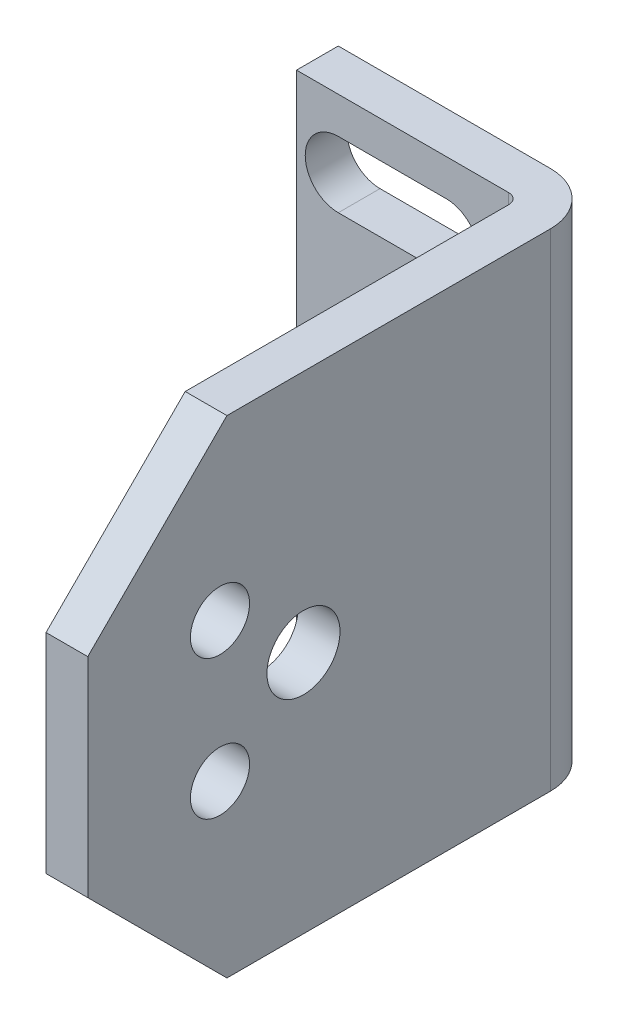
ISO-10303-21;
HEADER;
FILE_DESCRIPTION(('STEP AP214'),'2;1');
FILE_NAME('part.step','',(''),(''),'','','');
FILE_SCHEMA(('AUTOMOTIVE_DESIGN { 1 0 10303 214 1 1 1 1 }'));
ENDSEC;
DATA;
#1=APPLICATION_CONTEXT('core data for automotive mechanical design processes');
#2=APPLICATION_PROTOCOL_DEFINITION('international standard','automotive_design',2000,#1);
#3=PRODUCT_CONTEXT('',#1,'mechanical');
#4=PRODUCT('Part','Part','',(#3));
#5=PRODUCT_RELATED_PRODUCT_CATEGORY('part','',(#4));
#6=PRODUCT_DEFINITION_FORMATION('','',#4);
#7=PRODUCT_DEFINITION_CONTEXT('part definition',#1,'design');
#8=PRODUCT_DEFINITION('design','',#6,#7);
#9=PRODUCT_DEFINITION_SHAPE('','',#8);
#10=(LENGTH_UNIT() NAMED_UNIT(*) SI_UNIT(.MILLI.,.METRE.));
#11=(NAMED_UNIT(*) PLANE_ANGLE_UNIT() SI_UNIT($,.RADIAN.));
#12=(NAMED_UNIT(*) SI_UNIT($,.STERADIAN.) SOLID_ANGLE_UNIT());
#13=UNCERTAINTY_MEASURE_WITH_UNIT(LENGTH_MEASURE(1.E-05),#10,'distance_accuracy_value','');
#14=(GEOMETRIC_REPRESENTATION_CONTEXT(3) GLOBAL_UNCERTAINTY_ASSIGNED_CONTEXT((#13)) GLOBAL_UNIT_ASSIGNED_CONTEXT((#10,
#11,#12)) REPRESENTATION_CONTEXT('',''));
#15=CARTESIAN_POINT('',(0.,0.,0.));
#16=DIRECTION('',(0.,0.,1.));
#17=DIRECTION('',(1.,0.,0.));
#18=AXIS2_PLACEMENT_3D('',#15,#16,#17);
#19=CARTESIAN_POINT('',(26.,60.,74.));
#20=DIRECTION('',(0.,0.,-1.));
#21=DIRECTION('',(-1.,0.,0.));
#22=AXIS2_PLACEMENT_3D('',#19,#20,#21);
#23=PLANE('',#22);
#24=DIRECTION('',(0.,-1.,0.));
#25=VECTOR('',#24,1.);
#26=CARTESIAN_POINT('',(32.,60.,74.));
#27=LINE('',#26,#25);
#28=CARTESIAN_POINT('',(32.,40.,74.));
#29=VERTEX_POINT('',#28);
#30=CARTESIAN_POINT('',(32.,10.,74.));
#31=VERTEX_POINT('',#30);
#32=EDGE_CURVE('E252',#29,#31,#27,.T.);
#33=ORIENTED_EDGE('',*,*,#32,.F.);
#34=DIRECTION('',(-1.,0.,0.));
#35=VECTOR('',#34,1.);
#36=CARTESIAN_POINT('',(26.,40.,74.));
#37=LINE('',#36,#35);
#38=CARTESIAN_POINT('',(26.,40.,74.));
#39=VERTEX_POINT('',#38);
#40=EDGE_CURVE('E265',#29,#39,#37,.T.);
#41=ORIENTED_EDGE('',*,*,#40,.T.);
#42=DIRECTION('',(0.,-1.,0.));
#43=VECTOR('',#42,1.);
#44=CARTESIAN_POINT('',(26.,60.,74.));
#45=LINE('',#44,#43);
#46=CARTESIAN_POINT('',(26.,10.,74.));
#47=VERTEX_POINT('',#46);
#48=EDGE_CURVE('E217',#39,#47,#45,.T.);
#49=ORIENTED_EDGE('',*,*,#48,.T.);
#50=DIRECTION('',(1.,0.,0.));
#51=VECTOR('',#50,1.);
#52=CARTESIAN_POINT('',(26.,10.,74.));
#53=LINE('',#52,#51);
#54=EDGE_CURVE('E262',#47,#31,#53,.T.);
#55=ORIENTED_EDGE('',*,*,#54,.T.);
#56=EDGE_LOOP('',(#33,#41,#49,#55));
#57=FACE_BOUND('',#56,.T.);
#58=ADVANCED_FACE('F14',(#57),#23,.F.);
#59=CARTESIAN_POINT('',(32.,60.,74.));
#60=DIRECTION('',(-1.,0.,0.));
#61=DIRECTION('',(0.,0.,1.));
#62=AXIS2_PLACEMENT_3D('',#59,#60,#61);
#63=PLANE('',#62);
#64=CARTESIAN_POINT('',(32.,15.,55.));
#65=DIRECTION('',(1.,0.,0.));
#66=DIRECTION('',(0.,-1.,0.));
#67=AXIS2_PLACEMENT_3D('',#64,#65,#66);
#68=CIRCLE('',#67,4.25);
#69=CARTESIAN_POINT('',(32.,10.75,55.));
#70=VERTEX_POINT('',#69);
#71=EDGE_CURVE('E182',#70,#70,#68,.T.);
#72=ORIENTED_EDGE('',*,*,#71,.F.);
#73=EDGE_LOOP('',(#72));
#74=FACE_BOUND('',#73,.T.);
#75=CARTESIAN_POINT('',(32.,35.,55.));
#76=DIRECTION('',(1.,0.,0.));
#77=DIRECTION('',(0.,1.,0.));
#78=AXIS2_PLACEMENT_3D('',#75,#76,#77);
#79=CIRCLE('',#78,4.25);
#80=CARTESIAN_POINT('',(32.,39.25,55.));
#81=VERTEX_POINT('',#80);
#82=EDGE_CURVE('E193',#81,#81,#79,.T.);
#83=ORIENTED_EDGE('',*,*,#82,.F.);
#84=EDGE_LOOP('',(#83));
#85=FACE_BOUND('',#84,.T.);
#86=CARTESIAN_POINT('',(32.,25.,43.));
#87=DIRECTION('',(1.,0.,0.));
#88=DIRECTION('',(0.,1.,0.));
#89=AXIS2_PLACEMENT_3D('',#86,#87,#88);
#90=CIRCLE('',#89,5.25);
#91=CARTESIAN_POINT('',(32.,30.25,43.));
#92=VERTEX_POINT('',#91);
#93=EDGE_CURVE('E197',#92,#92,#90,.T.);
#94=ORIENTED_EDGE('',*,*,#93,.F.);
#95=EDGE_LOOP('',(#94));
#96=FACE_BOUND('',#95,.T.);
#97=DIRECTION('',(0.,0.,-1.));
#98=VECTOR('',#97,1.);
#99=CARTESIAN_POINT('',(32.,60.,74.));
#100=LINE('',#99,#98);
#101=CARTESIAN_POINT('',(32.,60.,54.));
#102=VERTEX_POINT('',#101);
#103=CARTESIAN_POINT('',(32.,60.,7.5));
#104=VERTEX_POINT('',#103);
#105=EDGE_CURVE('E201',#102,#104,#100,.T.);
#106=ORIENTED_EDGE('',*,*,#105,.F.);
#107=DIRECTION('',(0.,-0.707106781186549,0.707106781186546));
#108=VECTOR('',#107,1.);
#109=CARTESIAN_POINT('',(32.,60.,54.));
#110=LINE('',#109,#108);
#111=EDGE_CURVE('E260',#102,#29,#110,.T.);
#112=ORIENTED_EDGE('',*,*,#111,.T.);
#113=ORIENTED_EDGE('',*,*,#32,.T.);
#114=DIRECTION('',(0.,0.707106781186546,0.707106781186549));
#115=VECTOR('',#114,1.);
#116=CARTESIAN_POINT('',(32.,10.,74.));
#117=LINE('',#116,#115);
#118=CARTESIAN_POINT('',(32.,-10.,54.));
#119=VERTEX_POINT('',#118);
#120=EDGE_CURVE('E258',#31,#119,#117,.F.);
#121=ORIENTED_EDGE('',*,*,#120,.T.);
#122=DIRECTION('',(0.,0.,-1.));
#123=VECTOR('',#122,1.);
#124=CARTESIAN_POINT('',(32.,-10.,74.));
#125=LINE('',#124,#123);
#126=CARTESIAN_POINT('',(32.,-10.,7.5));
#127=VERTEX_POINT('',#126);
#128=EDGE_CURVE('E218',#119,#127,#125,.T.);
#129=ORIENTED_EDGE('',*,*,#128,.T.);
#130=DIRECTION('',(0.,-1.,0.));
#131=VECTOR('',#130,1.);
#132=CARTESIAN_POINT('',(32.,60.,7.5));
#133=LINE('',#132,#131);
#134=EDGE_CURVE('E249',#104,#127,#133,.T.);
#135=ORIENTED_EDGE('',*,*,#134,.F.);
#136=EDGE_LOOP('',(#106,#112,#113,#121,#129,#135));
#137=FACE_BOUND('',#136,.T.);
#138=ADVANCED_FACE('F313',(#74,#85,#96,#137),#63,.F.);
#139=CARTESIAN_POINT('',(24.5,60.,7.5));
#140=DIRECTION('',(0.,-1.,0.));
#141=DIRECTION('',(1.,0.,0.));
#142=AXIS2_PLACEMENT_3D('',#139,#140,#141);
#143=CYLINDRICAL_SURFACE('',#142,7.5);
#144=CARTESIAN_POINT('',(24.5,-10.,7.5));
#145=DIRECTION('',(0.,1.,0.));
#146=DIRECTION('',(-1.,0.,0.));
#147=AXIS2_PLACEMENT_3D('',#144,#145,#146);
#148=CIRCLE('',#147,7.5);
#149=CARTESIAN_POINT('',(24.5,-10.,0.));
#150=VERTEX_POINT('',#149);
#151=EDGE_CURVE('E220',#127,#150,#148,.T.);
#152=ORIENTED_EDGE('',*,*,#151,.T.);
#153=DIRECTION('',(0.,-1.,0.));
#154=VECTOR('',#153,1.);
#155=CARTESIAN_POINT('',(24.5,60.,0.));
#156=LINE('',#155,#154);
#157=CARTESIAN_POINT('',(24.5,60.,0.));
#158=VERTEX_POINT('',#157);
#159=EDGE_CURVE('E246',#158,#150,#156,.T.);
#160=ORIENTED_EDGE('',*,*,#159,.F.);
#161=CARTESIAN_POINT('',(24.5,60.,7.5));
#162=DIRECTION('',(0.,1.,0.));
#163=DIRECTION('',(-1.,0.,0.));
#164=AXIS2_PLACEMENT_3D('',#161,#162,#163);
#165=CIRCLE('',#164,7.5);
#166=EDGE_CURVE('E203',#104,#158,#165,.T.);
#167=ORIENTED_EDGE('',*,*,#166,.F.);
#168=ORIENTED_EDGE('',*,*,#134,.T.);
#169=EDGE_LOOP('',(#152,#160,#167,#168));
#170=FACE_BOUND('',#169,.T.);
#171=ADVANCED_FACE('F320',(#170),#143,.T.);
#172=CARTESIAN_POINT('',(24.5,60.,0.));
#173=DIRECTION('',(0.,0.,1.));
#174=DIRECTION('',(1.,0.,0.));
#175=AXIS2_PLACEMENT_3D('',#172,#173,#174);
#176=PLANE('',#175);
#177=DIRECTION('',(-1.,0.,0.));
#178=VECTOR('',#177,1.);
#179=CARTESIAN_POINT('',(15.5,4.75,0.));
#180=LINE('',#179,#178);
#181=CARTESIAN_POINT('',(15.5,4.75,0.));
#182=VERTEX_POINT('',#181);
#183=CARTESIAN_POINT('',(0.,4.75,0.));
#184=VERTEX_POINT('',#183);
#185=EDGE_CURVE('E146',#182,#184,#180,.T.);
#186=ORIENTED_EDGE('',*,*,#185,.T.);
#187=CARTESIAN_POINT('',(0.,0.,0.));
#188=DIRECTION('',(0.,0.,1.));
#189=DIRECTION('',(-1.,0.,0.));
#190=AXIS2_PLACEMENT_3D('',#187,#188,#189);
#191=CIRCLE('',#190,4.75);
#192=CARTESIAN_POINT('',(0.,-4.75,0.));
#193=VERTEX_POINT('',#192);
#194=EDGE_CURVE('E142',#184,#193,#191,.T.);
#195=ORIENTED_EDGE('',*,*,#194,.T.);
#196=DIRECTION('',(1.,0.,0.));
#197=VECTOR('',#196,1.);
#198=CARTESIAN_POINT('',(15.5,-4.75,0.));
#199=LINE('',#198,#197);
#200=CARTESIAN_POINT('',(15.5,-4.75,0.));
#201=VERTEX_POINT('',#200);
#202=EDGE_CURVE('E149',#193,#201,#199,.T.);
#203=ORIENTED_EDGE('',*,*,#202,.T.);
#204=CARTESIAN_POINT('',(15.5,0.,0.));
#205=DIRECTION('',(0.,0.,1.));
#206=DIRECTION('',(-1.,0.,0.));
#207=AXIS2_PLACEMENT_3D('',#204,#205,#206);
#208=CIRCLE('',#207,4.75);
#209=EDGE_CURVE('E29',#201,#182,#208,.T.);
#210=ORIENTED_EDGE('',*,*,#209,.T.);
#211=EDGE_LOOP('',(#186,#195,#203,#210));
#212=FACE_BOUND('',#211,.T.);
#213=DIRECTION('',(1.,0.,0.));
#214=VECTOR('',#213,1.);
#215=CARTESIAN_POINT('',(15.5,45.25,0.));
#216=LINE('',#215,#214);
#217=CARTESIAN_POINT('',(0.,45.25,0.));
#218=VERTEX_POINT('',#217);
#219=CARTESIAN_POINT('',(15.5,45.25,0.));
#220=VERTEX_POINT('',#219);
#221=EDGE_CURVE('E175',#218,#220,#216,.T.);
#222=ORIENTED_EDGE('',*,*,#221,.T.);
#223=CARTESIAN_POINT('',(15.5,50.,0.));
#224=DIRECTION('',(0.,0.,1.));
#225=DIRECTION('',(1.,0.,0.));
#226=AXIS2_PLACEMENT_3D('',#223,#224,#225);
#227=CIRCLE('',#226,4.75);
#228=CARTESIAN_POINT('',(15.5,54.75,0.));
#229=VERTEX_POINT('',#228);
#230=EDGE_CURVE('E162',#220,#229,#227,.T.);
#231=ORIENTED_EDGE('',*,*,#230,.T.);
#232=DIRECTION('',(-1.,0.,0.));
#233=VECTOR('',#232,1.);
#234=CARTESIAN_POINT('',(15.5,54.75,0.));
#235=LINE('',#234,#233);
#236=CARTESIAN_POINT('',(0.,54.75,0.));
#237=VERTEX_POINT('',#236);
#238=EDGE_CURVE('E169',#229,#237,#235,.T.);
#239=ORIENTED_EDGE('',*,*,#238,.T.);
#240=CARTESIAN_POINT('',(0.,50.,0.));
#241=DIRECTION('',(0.,0.,1.));
#242=DIRECTION('',(1.,0.,0.));
#243=AXIS2_PLACEMENT_3D('',#240,#241,#242);
#244=CIRCLE('',#243,4.75);
#245=EDGE_CURVE('E172',#237,#218,#244,.T.);
#246=ORIENTED_EDGE('',*,*,#245,.T.);
#247=EDGE_LOOP('',(#222,#231,#239,#246));
#248=FACE_BOUND('',#247,.T.);
#249=DIRECTION('',(-1.,0.,0.));
#250=VECTOR('',#249,1.);
#251=CARTESIAN_POINT('',(24.5,-10.,0.));
#252=LINE('',#251,#250);
#253=CARTESIAN_POINT('',(-6.,-10.,0.));
#254=VERTEX_POINT('',#253);
#255=EDGE_CURVE('E222',#150,#254,#252,.T.);
#256=ORIENTED_EDGE('',*,*,#255,.T.);
#257=DIRECTION('',(0.,-1.,0.));
#258=VECTOR('',#257,1.);
#259=CARTESIAN_POINT('',(-6.,60.,0.));
#260=LINE('',#259,#258);
#261=CARTESIAN_POINT('',(-6.,60.,0.));
#262=VERTEX_POINT('',#261);
#263=EDGE_CURVE('E243',#262,#254,#260,.T.);
#264=ORIENTED_EDGE('',*,*,#263,.F.);
#265=DIRECTION('',(-1.,0.,0.));
#266=VECTOR('',#265,1.);
#267=CARTESIAN_POINT('',(24.5,60.,0.));
#268=LINE('',#267,#266);
#269=EDGE_CURVE('E206',#158,#262,#268,.T.);
#270=ORIENTED_EDGE('',*,*,#269,.F.);
#271=ORIENTED_EDGE('',*,*,#159,.T.);
#272=EDGE_LOOP('',(#256,#264,#270,#271));
#273=FACE_BOUND('',#272,.T.);
#274=ADVANCED_FACE('F153',(#212,#248,#273),#176,.F.);
#275=CARTESIAN_POINT('',(-6.,60.,0.));
#276=DIRECTION('',(1.,0.,0.));
#277=DIRECTION('',(0.,1.,0.));
#278=AXIS2_PLACEMENT_3D('',#275,#276,#277);
#279=PLANE('',#278);
#280=DIRECTION('',(0.,0.,1.));
#281=VECTOR('',#280,1.);
#282=CARTESIAN_POINT('',(-6.,-10.,0.));
#283=LINE('',#282,#281);
#284=CARTESIAN_POINT('',(-6.,-10.,6.));
#285=VERTEX_POINT('',#284);
#286=EDGE_CURVE('E224',#254,#285,#283,.T.);
#287=ORIENTED_EDGE('',*,*,#286,.T.);
#288=DIRECTION('',(0.,-1.,0.));
#289=VECTOR('',#288,1.);
#290=CARTESIAN_POINT('',(-6.,60.,6.));
#291=LINE('',#290,#289);
#292=CARTESIAN_POINT('',(-6.,60.,6.));
#293=VERTEX_POINT('',#292);
#294=EDGE_CURVE('E240',#293,#285,#291,.T.);
#295=ORIENTED_EDGE('',*,*,#294,.F.);
#296=DIRECTION('',(0.,0.,1.));
#297=VECTOR('',#296,1.);
#298=CARTESIAN_POINT('',(-6.,60.,0.));
#299=LINE('',#298,#297);
#300=EDGE_CURVE('E208',#262,#293,#299,.T.);
#301=ORIENTED_EDGE('',*,*,#300,.F.);
#302=ORIENTED_EDGE('',*,*,#263,.T.);
#303=EDGE_LOOP('',(#287,#295,#301,#302));
#304=FACE_BOUND('',#303,.T.);
#305=ADVANCED_FACE('F375',(#304),#279,.F.);
#306=CARTESIAN_POINT('',(-6.,60.,6.));
#307=DIRECTION('',(0.,0.,-1.));
#308=DIRECTION('',(-1.,0.,0.));
#309=AXIS2_PLACEMENT_3D('',#306,#307,#308);
#310=PLANE('',#309);
#311=DIRECTION('',(-1.,0.,0.));
#312=VECTOR('',#311,1.);
#313=CARTESIAN_POINT('',(-6.,-4.75,6.));
#314=LINE('',#313,#312);
#315=CARTESIAN_POINT('',(15.5,-4.75,6.));
#316=VERTEX_POINT('',#315);
#317=CARTESIAN_POINT('',(0.,-4.75,6.));
#318=VERTEX_POINT('',#317);
#319=EDGE_CURVE('E291',#316,#318,#314,.T.);
#320=ORIENTED_EDGE('',*,*,#319,.T.);
#321=CARTESIAN_POINT('',(0.,0.,6.));
#322=DIRECTION('',(0.,0.,-1.));
#323=DIRECTION('',(-1.,0.,0.));
#324=AXIS2_PLACEMENT_3D('',#321,#322,#323);
#325=CIRCLE('',#324,4.75);
#326=CARTESIAN_POINT('',(0.,4.75,6.));
#327=VERTEX_POINT('',#326);
#328=EDGE_CURVE('E9',#318,#327,#325,.T.);
#329=ORIENTED_EDGE('',*,*,#328,.T.);
#330=DIRECTION('',(1.,0.,0.));
#331=VECTOR('',#330,1.);
#332=CARTESIAN_POINT('',(-6.,4.75,6.));
#333=LINE('',#332,#331);
#334=CARTESIAN_POINT('',(15.5,4.75,6.));
#335=VERTEX_POINT('',#334);
#336=EDGE_CURVE('E22',#327,#335,#333,.T.);
#337=ORIENTED_EDGE('',*,*,#336,.T.);
#338=CARTESIAN_POINT('',(15.5,0.,6.));
#339=DIRECTION('',(0.,0.,-1.));
#340=DIRECTION('',(-1.,0.,0.));
#341=AXIS2_PLACEMENT_3D('',#338,#339,#340);
#342=CIRCLE('',#341,4.75);
#343=EDGE_CURVE('E293',#335,#316,#342,.T.);
#344=ORIENTED_EDGE('',*,*,#343,.T.);
#345=EDGE_LOOP('',(#320,#329,#337,#344));
#346=FACE_BOUND('',#345,.T.);
#347=DIRECTION('',(1.,0.,0.));
#348=VECTOR('',#347,1.);
#349=CARTESIAN_POINT('',(-6.,54.75,6.));
#350=LINE('',#349,#348);
#351=CARTESIAN_POINT('',(0.,54.75,6.));
#352=VERTEX_POINT('',#351);
#353=CARTESIAN_POINT('',(15.5,54.75,6.));
#354=VERTEX_POINT('',#353);
#355=EDGE_CURVE('E273',#352,#354,#350,.T.);
#356=ORIENTED_EDGE('',*,*,#355,.T.);
#357=CARTESIAN_POINT('',(15.5,50.,6.));
#358=DIRECTION('',(0.,0.,-1.));
#359=DIRECTION('',(-1.,0.,0.));
#360=AXIS2_PLACEMENT_3D('',#357,#358,#359);
#361=CIRCLE('',#360,4.75);
#362=CARTESIAN_POINT('',(15.5,45.25,6.));
#363=VERTEX_POINT('',#362);
#364=EDGE_CURVE('E288',#354,#363,#361,.T.);
#365=ORIENTED_EDGE('',*,*,#364,.T.);
#366=DIRECTION('',(-1.,0.,0.));
#367=VECTOR('',#366,1.);
#368=CARTESIAN_POINT('',(-6.,45.25,6.));
#369=LINE('',#368,#367);
#370=CARTESIAN_POINT('',(0.,45.25,6.));
#371=VERTEX_POINT('',#370);
#372=EDGE_CURVE('E285',#363,#371,#369,.T.);
#373=ORIENTED_EDGE('',*,*,#372,.T.);
#374=CARTESIAN_POINT('',(0.,50.,6.));
#375=DIRECTION('',(0.,0.,-1.));
#376=DIRECTION('',(-1.,0.,0.));
#377=AXIS2_PLACEMENT_3D('',#374,#375,#376);
#378=CIRCLE('',#377,4.75);
#379=EDGE_CURVE('E282',#371,#352,#378,.T.);
#380=ORIENTED_EDGE('',*,*,#379,.T.);
#381=EDGE_LOOP('',(#356,#365,#373,#380));
#382=FACE_BOUND('',#381,.T.);
#383=DIRECTION('',(1.,0.,0.));
#384=VECTOR('',#383,1.);
#385=CARTESIAN_POINT('',(-6.,-10.,6.));
#386=LINE('',#385,#384);
#387=CARTESIAN_POINT('',(24.5,-10.,6.));
#388=VERTEX_POINT('',#387);
#389=EDGE_CURVE('E226',#285,#388,#386,.T.);
#390=ORIENTED_EDGE('',*,*,#389,.T.);
#391=DIRECTION('',(0.,-1.,0.));
#392=VECTOR('',#391,1.);
#393=CARTESIAN_POINT('',(24.5,60.,6.));
#394=LINE('',#393,#392);
#395=CARTESIAN_POINT('',(24.5,60.,6.));
#396=VERTEX_POINT('',#395);
#397=EDGE_CURVE('E237',#396,#388,#394,.T.);
#398=ORIENTED_EDGE('',*,*,#397,.F.);
#399=DIRECTION('',(1.,0.,0.));
#400=VECTOR('',#399,1.);
#401=CARTESIAN_POINT('',(-6.,60.,6.));
#402=LINE('',#401,#400);
#403=EDGE_CURVE('E210',#293,#396,#402,.T.);
#404=ORIENTED_EDGE('',*,*,#403,.F.);
#405=ORIENTED_EDGE('',*,*,#294,.T.);
#406=EDGE_LOOP('',(#390,#398,#404,#405));
#407=FACE_BOUND('',#406,.T.);
#408=ADVANCED_FACE('F297',(#346,#382,#407),#310,.F.);
#409=CARTESIAN_POINT('',(24.5,60.,7.5));
#410=DIRECTION('',(0.,-1.,0.));
#411=DIRECTION('',(1.,0.,0.));
#412=AXIS2_PLACEMENT_3D('',#409,#410,#411);
#413=CYLINDRICAL_SURFACE('',#412,1.5);
#414=CARTESIAN_POINT('',(24.5,-10.,7.5));
#415=DIRECTION('',(0.,-1.,0.));
#416=DIRECTION('',(-1.,0.,0.));
#417=AXIS2_PLACEMENT_3D('',#414,#415,#416);
#418=CIRCLE('',#417,1.5);
#419=CARTESIAN_POINT('',(26.,-10.,7.5));
#420=VERTEX_POINT('',#419);
#421=EDGE_CURVE('E228',#388,#420,#418,.T.);
#422=ORIENTED_EDGE('',*,*,#421,.T.);
#423=DIRECTION('',(0.,-1.,0.));
#424=VECTOR('',#423,1.);
#425=CARTESIAN_POINT('',(26.,60.,7.5));
#426=LINE('',#425,#424);
#427=CARTESIAN_POINT('',(26.,60.,7.5));
#428=VERTEX_POINT('',#427);
#429=EDGE_CURVE('E234',#428,#420,#426,.T.);
#430=ORIENTED_EDGE('',*,*,#429,.F.);
#431=CARTESIAN_POINT('',(24.5,60.,7.5));
#432=DIRECTION('',(0.,-1.,0.));
#433=DIRECTION('',(-1.,0.,0.));
#434=AXIS2_PLACEMENT_3D('',#431,#432,#433);
#435=CIRCLE('',#434,1.5);
#436=EDGE_CURVE('E212',#396,#428,#435,.T.);
#437=ORIENTED_EDGE('',*,*,#436,.F.);
#438=ORIENTED_EDGE('',*,*,#397,.T.);
#439=EDGE_LOOP('',(#422,#430,#437,#438));
#440=FACE_BOUND('',#439,.T.);
#441=ADVANCED_FACE('F353',(#440),#413,.F.);
#442=CARTESIAN_POINT('',(26.,60.,7.5));
#443=DIRECTION('',(1.,0.,0.));
#444=DIRECTION('',(0.,0.,-1.));
#445=AXIS2_PLACEMENT_3D('',#442,#443,#444);
#446=PLANE('',#445);
#447=CARTESIAN_POINT('',(26.,15.,55.));
#448=DIRECTION('',(1.,0.,0.));
#449=DIRECTION('',(0.,0.,-1.));
#450=AXIS2_PLACEMENT_3D('',#447,#448,#449);
#451=CIRCLE('',#450,4.25);
#452=CARTESIAN_POINT('',(26.,15.,50.75));
#453=VERTEX_POINT('',#452);
#454=EDGE_CURVE('E192',#453,#453,#451,.T.);
#455=ORIENTED_EDGE('',*,*,#454,.T.);
#456=EDGE_LOOP('',(#455));
#457=FACE_BOUND('',#456,.T.);
#458=CARTESIAN_POINT('',(26.,35.,55.));
#459=DIRECTION('',(1.,0.,0.));
#460=DIRECTION('',(0.,0.,-1.));
#461=AXIS2_PLACEMENT_3D('',#458,#459,#460);
#462=CIRCLE('',#461,4.25);
#463=CARTESIAN_POINT('',(26.,35.,50.75));
#464=VERTEX_POINT('',#463);
#465=EDGE_CURVE('E196',#464,#464,#462,.T.);
#466=ORIENTED_EDGE('',*,*,#465,.T.);
#467=EDGE_LOOP('',(#466));
#468=FACE_BOUND('',#467,.T.);
#469=CARTESIAN_POINT('',(26.,25.,43.));
#470=DIRECTION('',(1.,0.,0.));
#471=DIRECTION('',(0.,0.,-1.));
#472=AXIS2_PLACEMENT_3D('',#469,#470,#471);
#473=CIRCLE('',#472,5.25);
#474=CARTESIAN_POINT('',(26.,25.,37.75));
#475=VERTEX_POINT('',#474);
#476=EDGE_CURVE('E200',#475,#475,#473,.T.);
#477=ORIENTED_EDGE('',*,*,#476,.T.);
#478=EDGE_LOOP('',(#477));
#479=FACE_BOUND('',#478,.T.);
#480=ORIENTED_EDGE('',*,*,#48,.F.);
#481=DIRECTION('',(0.,0.707106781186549,-0.707106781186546));
#482=VECTOR('',#481,1.);
#483=CARTESIAN_POINT('',(26.,60.,54.));
#484=LINE('',#483,#482);
#485=CARTESIAN_POINT('',(26.,60.,54.));
#486=VERTEX_POINT('',#485);
#487=EDGE_CURVE('E269',#39,#486,#484,.T.);
#488=ORIENTED_EDGE('',*,*,#487,.T.);
#489=DIRECTION('',(0.,0.,1.));
#490=VECTOR('',#489,1.);
#491=CARTESIAN_POINT('',(26.,60.,7.5));
#492=LINE('',#491,#490);
#493=EDGE_CURVE('E214',#428,#486,#492,.T.);
#494=ORIENTED_EDGE('',*,*,#493,.F.);
#495=ORIENTED_EDGE('',*,*,#429,.T.);
#496=DIRECTION('',(0.,0.,1.));
#497=VECTOR('',#496,1.);
#498=CARTESIAN_POINT('',(26.,-10.,7.5));
#499=LINE('',#498,#497);
#500=CARTESIAN_POINT('',(26.,-10.,54.));
#501=VERTEX_POINT('',#500);
#502=EDGE_CURVE('E204',#420,#501,#499,.T.);
#503=ORIENTED_EDGE('',*,*,#502,.T.);
#504=DIRECTION('',(0.,-0.707106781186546,-0.707106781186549));
#505=VECTOR('',#504,1.);
#506=CARTESIAN_POINT('',(26.,10.,74.));
#507=LINE('',#506,#505);
#508=EDGE_CURVE('E267',#501,#47,#507,.F.);
#509=ORIENTED_EDGE('',*,*,#508,.T.);
#510=EDGE_LOOP('',(#480,#488,#494,#495,#503,#509));
#511=FACE_BOUND('',#510,.T.);
#512=ADVANCED_FACE('F345',(#457,#468,#479,#511),#446,.F.);
#513=CARTESIAN_POINT('',(24.5,60.,7.5));
#514=DIRECTION('',(0.,1.,0.));
#515=DIRECTION('',(-1.,0.,0.));
#516=AXIS2_PLACEMENT_3D('',#513,#514,#515);
#517=PLANE('',#516);
#518=ORIENTED_EDGE('',*,*,#493,.T.);
#519=DIRECTION('',(1.,0.,0.));
#520=VECTOR('',#519,1.);
#521=CARTESIAN_POINT('',(32.,60.,54.));
#522=LINE('',#521,#520);
#523=EDGE_CURVE('E255',#486,#102,#522,.T.);
#524=ORIENTED_EDGE('',*,*,#523,.T.);
#525=ORIENTED_EDGE('',*,*,#105,.T.);
#526=ORIENTED_EDGE('',*,*,#166,.T.);
#527=ORIENTED_EDGE('',*,*,#269,.T.);
#528=ORIENTED_EDGE('',*,*,#300,.T.);
#529=ORIENTED_EDGE('',*,*,#403,.T.);
#530=ORIENTED_EDGE('',*,*,#436,.T.);
#531=EDGE_LOOP('',(#518,#524,#525,#526,#527,#528,#529,#530));
#532=FACE_BOUND('',#531,.T.);
#533=ADVANCED_FACE('F336',(#532),#517,.T.);
#534=CARTESIAN_POINT('',(24.5,-10.,7.5));
#535=DIRECTION('',(0.,1.,0.));
#536=DIRECTION('',(-1.,0.,0.));
#537=AXIS2_PLACEMENT_3D('',#534,#535,#536);
#538=PLANE('',#537);
#539=ORIENTED_EDGE('',*,*,#128,.F.);
#540=DIRECTION('',(-1.,0.,0.));
#541=VECTOR('',#540,1.);
#542=CARTESIAN_POINT('',(24.5,-10.,54.));
#543=LINE('',#542,#541);
#544=EDGE_CURVE('E271',#119,#501,#543,.T.);
#545=ORIENTED_EDGE('',*,*,#544,.T.);
#546=ORIENTED_EDGE('',*,*,#502,.F.);
#547=ORIENTED_EDGE('',*,*,#421,.F.);
#548=ORIENTED_EDGE('',*,*,#389,.F.);
#549=ORIENTED_EDGE('',*,*,#286,.F.);
#550=ORIENTED_EDGE('',*,*,#255,.F.);
#551=ORIENTED_EDGE('',*,*,#151,.F.);
#552=EDGE_LOOP('',(#539,#545,#546,#547,#548,#549,#550,#551));
#553=FACE_BOUND('',#552,.T.);
#554=ADVANCED_FACE('F327',(#553),#538,.F.);
#555=CARTESIAN_POINT('',(24.5,60.,54.));
#556=DIRECTION('',(0.,0.707106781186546,0.707106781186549));
#557=DIRECTION('',(0.,-0.707106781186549,0.707106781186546));
#558=AXIS2_PLACEMENT_3D('',#555,#556,#557);
#559=PLANE('',#558);
#560=ORIENTED_EDGE('',*,*,#487,.F.);
#561=ORIENTED_EDGE('',*,*,#40,.F.);
#562=ORIENTED_EDGE('',*,*,#111,.F.);
#563=ORIENTED_EDGE('',*,*,#523,.F.);
#564=EDGE_LOOP('',(#560,#561,#562,#563));
#565=FACE_BOUND('',#564,.T.);
#566=ADVANCED_FACE('F325',(#565),#559,.T.);
#567=CARTESIAN_POINT('',(26.,10.,74.));
#568=DIRECTION('',(0.,0.707106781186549,-0.707106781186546));
#569=DIRECTION('',(0.,0.707106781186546,0.707106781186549));
#570=AXIS2_PLACEMENT_3D('',#567,#568,#569);
#571=PLANE('',#570);
#572=ORIENTED_EDGE('',*,*,#508,.F.);
#573=ORIENTED_EDGE('',*,*,#544,.F.);
#574=ORIENTED_EDGE('',*,*,#120,.F.);
#575=ORIENTED_EDGE('',*,*,#54,.F.);
#576=EDGE_LOOP('',(#572,#573,#574,#575));
#577=FACE_BOUND('',#576,.T.);
#578=ADVANCED_FACE('F16',(#577),#571,.F.);
#579=CARTESIAN_POINT('',(-6.,25.,43.));
#580=DIRECTION('',(1.,0.,0.));
#581=DIRECTION('',(0.,1.,0.));
#582=AXIS2_PLACEMENT_3D('',#579,#580,#581);
#583=CYLINDRICAL_SURFACE('',#582,5.25);
#584=ORIENTED_EDGE('',*,*,#93,.T.);
#585=EDGE_LOOP('',(#584));
#586=FACE_BOUND('',#585,.T.);
#587=ORIENTED_EDGE('',*,*,#476,.F.);
#588=EDGE_LOOP('',(#587));
#589=FACE_BOUND('',#588,.T.);
#590=ADVANCED_FACE('F334',(#586,#589),#583,.F.);
#591=CARTESIAN_POINT('',(-6.,35.,55.));
#592=DIRECTION('',(1.,0.,0.));
#593=DIRECTION('',(0.,1.,0.));
#594=AXIS2_PLACEMENT_3D('',#591,#592,#593);
#595=CYLINDRICAL_SURFACE('',#594,4.25);
#596=ORIENTED_EDGE('',*,*,#82,.T.);
#597=EDGE_LOOP('',(#596));
#598=FACE_BOUND('',#597,.T.);
#599=ORIENTED_EDGE('',*,*,#465,.F.);
#600=EDGE_LOOP('',(#599));
#601=FACE_BOUND('',#600,.T.);
#602=ADVANCED_FACE('F517',(#598,#601),#595,.F.);
#603=CARTESIAN_POINT('',(-6.,15.,55.));
#604=DIRECTION('',(1.,0.,0.));
#605=DIRECTION('',(0.,1.,0.));
#606=AXIS2_PLACEMENT_3D('',#603,#604,#605);
#607=CYLINDRICAL_SURFACE('',#606,4.25);
#608=ORIENTED_EDGE('',*,*,#71,.T.);
#609=EDGE_LOOP('',(#608));
#610=FACE_BOUND('',#609,.T.);
#611=ORIENTED_EDGE('',*,*,#454,.F.);
#612=EDGE_LOOP('',(#611));
#613=FACE_BOUND('',#612,.T.);
#614=ADVANCED_FACE('F508',(#610,#613),#607,.F.);
#615=CARTESIAN_POINT('',(15.5,50.,0.));
#616=DIRECTION('',(0.,0.,1.));
#617=DIRECTION('',(1.,0.,0.));
#618=AXIS2_PLACEMENT_3D('',#615,#616,#617);
#619=CYLINDRICAL_SURFACE('',#618,4.75);
#620=DIRECTION('',(0.,0.,1.));
#621=VECTOR('',#620,1.);
#622=CARTESIAN_POINT('',(15.5,54.75,0.));
#623=LINE('',#622,#621);
#624=EDGE_CURVE('E178',#229,#354,#623,.T.);
#625=ORIENTED_EDGE('',*,*,#624,.F.);
#626=ORIENTED_EDGE('',*,*,#230,.F.);
#627=DIRECTION('',(0.,0.,1.));
#628=VECTOR('',#627,1.);
#629=CARTESIAN_POINT('',(15.5,45.25,0.));
#630=LINE('',#629,#628);
#631=EDGE_CURVE('E179',#220,#363,#630,.T.);
#632=ORIENTED_EDGE('',*,*,#631,.T.);
#633=ORIENTED_EDGE('',*,*,#364,.F.);
#634=EDGE_LOOP('',(#625,#626,#632,#633));
#635=FACE_BOUND('',#634,.T.);
#636=ADVANCED_FACE('F499',(#635),#619,.F.);
#637=CARTESIAN_POINT('',(15.5,45.25,0.));
#638=DIRECTION('',(0.,-1.,0.));
#639=DIRECTION('',(1.,0.,0.));
#640=AXIS2_PLACEMENT_3D('',#637,#638,#639);
#641=PLANE('',#640);
#642=ORIENTED_EDGE('',*,*,#631,.F.);
#643=ORIENTED_EDGE('',*,*,#221,.F.);
#644=DIRECTION('',(0.,0.,1.));
#645=VECTOR('',#644,1.);
#646=CARTESIAN_POINT('',(0.,45.25,0.));
#647=LINE('',#646,#645);
#648=EDGE_CURVE('E183',#218,#371,#647,.T.);
#649=ORIENTED_EDGE('',*,*,#648,.T.);
#650=ORIENTED_EDGE('',*,*,#372,.F.);
#651=EDGE_LOOP('',(#642,#643,#649,#650));
#652=FACE_BOUND('',#651,.T.);
#653=ADVANCED_FACE('F490',(#652),#641,.F.);
#654=CARTESIAN_POINT('',(0.,50.,0.));
#655=DIRECTION('',(0.,0.,1.));
#656=DIRECTION('',(1.,0.,0.));
#657=AXIS2_PLACEMENT_3D('',#654,#655,#656);
#658=CYLINDRICAL_SURFACE('',#657,4.75);
#659=ORIENTED_EDGE('',*,*,#648,.F.);
#660=ORIENTED_EDGE('',*,*,#245,.F.);
#661=DIRECTION('',(0.,0.,1.));
#662=VECTOR('',#661,1.);
#663=CARTESIAN_POINT('',(0.,54.75,0.));
#664=LINE('',#663,#662);
#665=EDGE_CURVE('E186',#237,#352,#664,.T.);
#666=ORIENTED_EDGE('',*,*,#665,.T.);
#667=ORIENTED_EDGE('',*,*,#379,.F.);
#668=EDGE_LOOP('',(#659,#660,#666,#667));
#669=FACE_BOUND('',#668,.T.);
#670=ADVANCED_FACE('F481',(#669),#658,.F.);
#671=CARTESIAN_POINT('',(15.5,54.75,0.));
#672=DIRECTION('',(0.,1.,0.));
#673=DIRECTION('',(-1.,0.,0.));
#674=AXIS2_PLACEMENT_3D('',#671,#672,#673);
#675=PLANE('',#674);
#676=ORIENTED_EDGE('',*,*,#665,.F.);
#677=ORIENTED_EDGE('',*,*,#238,.F.);
#678=ORIENTED_EDGE('',*,*,#624,.T.);
#679=ORIENTED_EDGE('',*,*,#355,.F.);
#680=EDGE_LOOP('',(#676,#677,#678,#679));
#681=FACE_BOUND('',#680,.T.);
#682=ADVANCED_FACE('F474',(#681),#675,.F.);
#683=CARTESIAN_POINT('',(0.,0.,0.));
#684=DIRECTION('',(0.,0.,1.));
#685=DIRECTION('',(1.,0.,0.));
#686=AXIS2_PLACEMENT_3D('',#683,#684,#685);
#687=CYLINDRICAL_SURFACE('',#686,4.75);
#688=DIRECTION('',(0.,0.,1.));
#689=VECTOR('',#688,1.);
#690=CARTESIAN_POINT('',(0.,-4.75,0.));
#691=LINE('',#690,#689);
#692=EDGE_CURVE('E37',#193,#318,#691,.T.);
#693=ORIENTED_EDGE('',*,*,#692,.F.);
#694=ORIENTED_EDGE('',*,*,#194,.F.);
#695=DIRECTION('',(0.,0.,1.));
#696=VECTOR('',#695,1.);
#697=CARTESIAN_POINT('',(0.,4.75,0.));
#698=LINE('',#697,#696);
#699=EDGE_CURVE('E160',#184,#327,#698,.T.);
#700=ORIENTED_EDGE('',*,*,#699,.T.);
#701=ORIENTED_EDGE('',*,*,#328,.F.);
#702=EDGE_LOOP('',(#693,#694,#700,#701));
#703=FACE_BOUND('',#702,.T.);
#704=ADVANCED_FACE('F139',(#703),#687,.F.);
#705=CARTESIAN_POINT('',(15.5,4.75,0.));
#706=DIRECTION('',(0.,1.,0.));
#707=DIRECTION('',(-1.,0.,0.));
#708=AXIS2_PLACEMENT_3D('',#705,#706,#707);
#709=PLANE('',#708);
#710=ORIENTED_EDGE('',*,*,#699,.F.);
#711=ORIENTED_EDGE('',*,*,#185,.F.);
#712=DIRECTION('',(0.,0.,1.));
#713=VECTOR('',#712,1.);
#714=CARTESIAN_POINT('',(15.5,4.75,0.));
#715=LINE('',#714,#713);
#716=EDGE_CURVE('E163',#182,#335,#715,.T.);
#717=ORIENTED_EDGE('',*,*,#716,.T.);
#718=ORIENTED_EDGE('',*,*,#336,.F.);
#719=EDGE_LOOP('',(#710,#711,#717,#718));
#720=FACE_BOUND('',#719,.T.);
#721=ADVANCED_FACE('F300',(#720),#709,.F.);
#722=CARTESIAN_POINT('',(15.5,0.,0.));
#723=DIRECTION('',(0.,0.,1.));
#724=DIRECTION('',(1.,0.,0.));
#725=AXIS2_PLACEMENT_3D('',#722,#723,#724);
#726=CYLINDRICAL_SURFACE('',#725,4.75);
#727=ORIENTED_EDGE('',*,*,#716,.F.);
#728=ORIENTED_EDGE('',*,*,#209,.F.);
#729=DIRECTION('',(0.,0.,1.));
#730=VECTOR('',#729,1.);
#731=CARTESIAN_POINT('',(15.5,-4.75,0.));
#732=LINE('',#731,#730);
#733=EDGE_CURVE('E145',#201,#316,#732,.T.);
#734=ORIENTED_EDGE('',*,*,#733,.T.);
#735=ORIENTED_EDGE('',*,*,#343,.F.);
#736=EDGE_LOOP('',(#727,#728,#734,#735));
#737=FACE_BOUND('',#736,.T.);
#738=ADVANCED_FACE('F301',(#737),#726,.F.);
#739=CARTESIAN_POINT('',(15.5,-4.75,0.));
#740=DIRECTION('',(0.,-1.,0.));
#741=DIRECTION('',(1.,0.,0.));
#742=AXIS2_PLACEMENT_3D('',#739,#740,#741);
#743=PLANE('',#742);
#744=ORIENTED_EDGE('',*,*,#733,.F.);
#745=ORIENTED_EDGE('',*,*,#202,.F.);
#746=ORIENTED_EDGE('',*,*,#692,.T.);
#747=ORIENTED_EDGE('',*,*,#319,.F.);
#748=EDGE_LOOP('',(#744,#745,#746,#747));
#749=FACE_BOUND('',#748,.T.);
#750=ADVANCED_FACE('F150',(#749),#743,.F.);
#751=CLOSED_SHELL('',(#58,#138,#171,#274,#305,#408,#441,#512,#533,#554,#566,#578,#590,#602,#614,
#636,#653,#670,#682,#704,#721,#738,#750));
#752=MANIFOLD_SOLID_BREP('B1',#751);
#753=ADVANCED_BREP_SHAPE_REPRESENTATION('',(#18,#752),#14);
#754=SHAPE_DEFINITION_REPRESENTATION(#9,#753);
ENDSEC;
END-ISO-10303-21;
